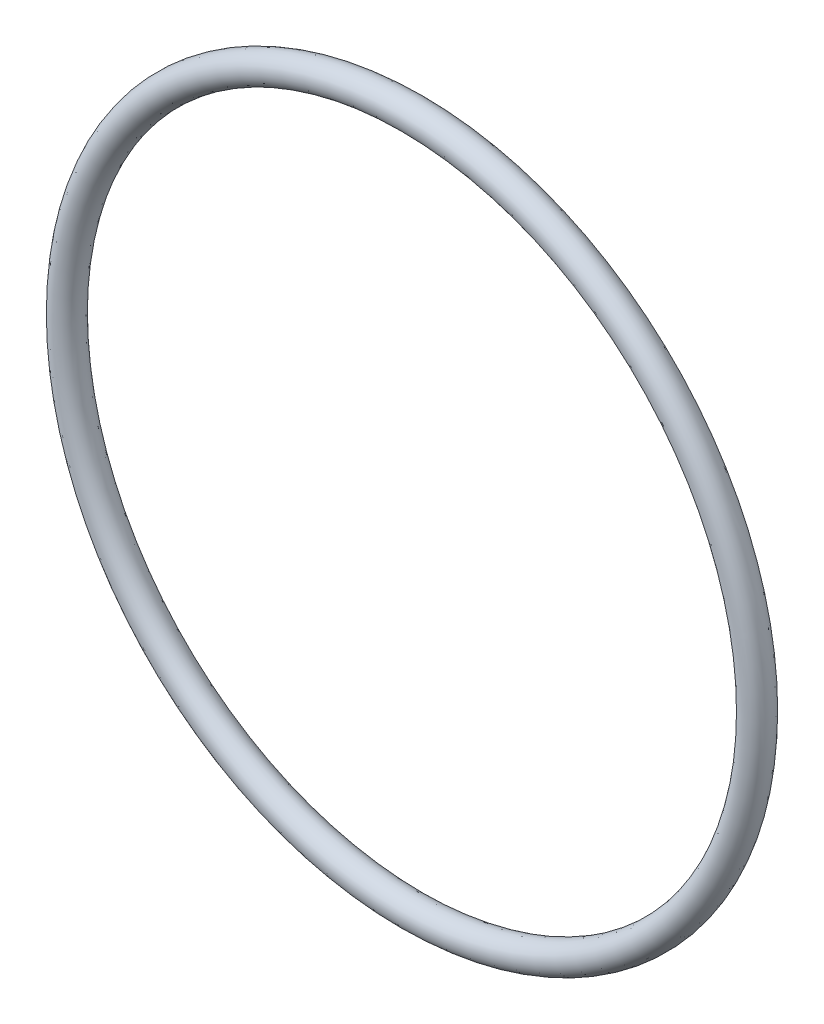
ISO-10303-21;
HEADER;
FILE_DESCRIPTION(('STEP AP214'),'2;1');
FILE_NAME('part.step','',(''),(''),'','','');
FILE_SCHEMA(('AUTOMOTIVE_DESIGN { 1 0 10303 214 1 1 1 1 }'));
ENDSEC;
DATA;
#1=APPLICATION_CONTEXT('core data for automotive mechanical design processes');
#2=APPLICATION_PROTOCOL_DEFINITION('international standard','automotive_design',2000,#1);
#3=PRODUCT_CONTEXT('',#1,'mechanical');
#4=PRODUCT('Part','Part','',(#3));
#5=PRODUCT_RELATED_PRODUCT_CATEGORY('part','',(#4));
#6=PRODUCT_DEFINITION_FORMATION('','',#4);
#7=PRODUCT_DEFINITION_CONTEXT('part definition',#1,'design');
#8=PRODUCT_DEFINITION('design','',#6,#7);
#9=PRODUCT_DEFINITION_SHAPE('','',#8);
#10=(LENGTH_UNIT() NAMED_UNIT(*) SI_UNIT(.MILLI.,.METRE.));
#11=(NAMED_UNIT(*) PLANE_ANGLE_UNIT() SI_UNIT($,.RADIAN.));
#12=(NAMED_UNIT(*) SI_UNIT($,.STERADIAN.) SOLID_ANGLE_UNIT());
#13=UNCERTAINTY_MEASURE_WITH_UNIT(LENGTH_MEASURE(1.E-05),#10,'distance_accuracy_value','');
#14=(GEOMETRIC_REPRESENTATION_CONTEXT(3) GLOBAL_UNCERTAINTY_ASSIGNED_CONTEXT((#13)) GLOBAL_UNIT_ASSIGNED_CONTEXT((#10,
#11,#12)) REPRESENTATION_CONTEXT('',''));
#15=CARTESIAN_POINT('',(0.,0.,0.));
#16=DIRECTION('',(0.,0.,1.));
#17=DIRECTION('',(1.,0.,0.));
#18=AXIS2_PLACEMENT_3D('',#15,#16,#17);
#19=CARTESIAN_POINT('',(0.,82.525,-3.495));
#20=DIRECTION('',(1.,0.,0.));
#21=DIRECTION('',(0.,0.,-1.));
#22=AXIS2_PLACEMENT_3D('',#19,#20,#21);
#23=ELLIPSE('',#22,3.495,3.47500000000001);
#24=CARTESIAN_POINT('',(0.,0.,0.));
#25=DIRECTION('',(0.,0.,1.));
#26=AXIS1_PLACEMENT('',#24,#25);
#27=SURFACE_OF_REVOLUTION('',#23,#26);
#28=ADVANCED_FACE('F28',(),#27,.T.);
#29=CLOSED_SHELL('',(#28));
#30=MANIFOLD_SOLID_BREP('B2',#29);
#31=ADVANCED_BREP_SHAPE_REPRESENTATION('',(#18,#30),#14);
#32=SHAPE_DEFINITION_REPRESENTATION(#9,#31);
ENDSEC;
END-ISO-10303-21;
